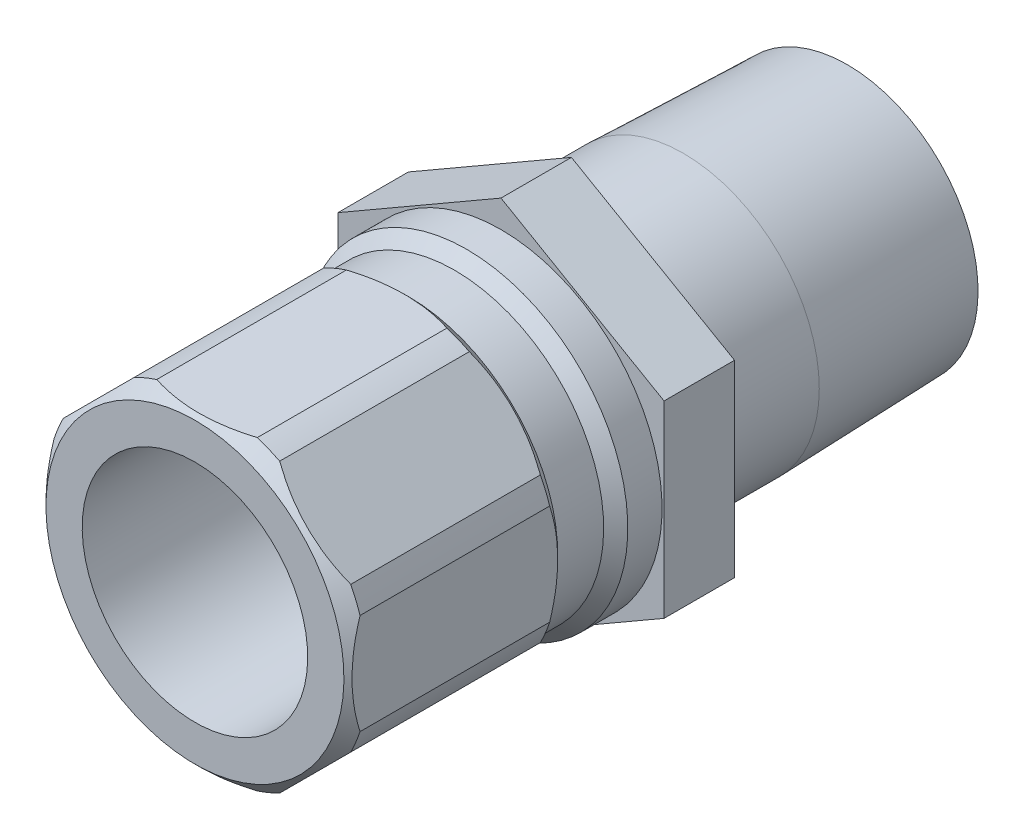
from build123d import *

# Parameters (mm, degrees)
SKETCH2_R           = 6.2611
BOSS_EXTRUDE1_DEPTH = 4.445
CUT_EXTRUDE1_START  = 5.8166
SKETCH3_OUTSIDE_W   = 32.93
SKETCH3_OUTSIDE_H   = 36.112
CUT_EXTRUDE1_DEPTH  = 22.092119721


with BuildPart() as part:
    # Sketch1 → Revolve1 (revolve)
    with BuildSketch(Plane(origin=(0, 0, 0), x_dir=(0, 0, -1), z_dir=(1, 0, 0))):
        Polygon((-19.304, 7.112), (-19.304, 9.398), (-18.542, 10.16), (-6.5786, 10.16), (-5.8166, 9.398), (-2.921, 9.398), (-2.159, 10.16), (0, 10.16), (0, 8.5725), (11.5062, 8.5725), (21.844, 8.249445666), (21.844, 6.2611), (-1.071568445, 6.2611), (-1.524, 7.112), align=None)
    revolve(axis=Axis((0, 0, 0), (0, 0, 1)))

    # Sketch2 → Boss-Extrude1 (add)
    with BuildSketch(Plane.XY):
        Polygon((-10.287, 5.939202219), (-10.287, -5.939202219), (0, -11.878404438), (10.287, -5.939202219), (10.287, 5.939202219), (0, 11.878404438), align=None)
        with Locations(Location((0, 0, 0), (0, 0, 90))):
            Circle(SKETCH2_R, mode=Mode.SUBTRACT)
    extrude(amount=-BOSS_EXTRUDE1_DEPTH)

    # Sketch3 outside → Cut-Extrude1 (cut, through all)
    with BuildSketch(Plane.XY.offset(CUT_EXTRUDE1_START)):
        Rectangle(SKETCH3_OUTSIDE_W, SKETCH3_OUTSIDE_H)
        Polygon((9.652, -3.997989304), (9.652, 3.997989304), (3.997989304, 9.652), (-3.997989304, 9.652), (-9.652, 3.997989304), (-9.652, -3.997989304), (-3.997989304, -9.652), (3.997989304, -9.652), align=None, mode=Mode.SUBTRACT)
    extrude(amount=CUT_EXTRUDE1_DEPTH, mode=Mode.SUBTRACT)


solid = part.part
